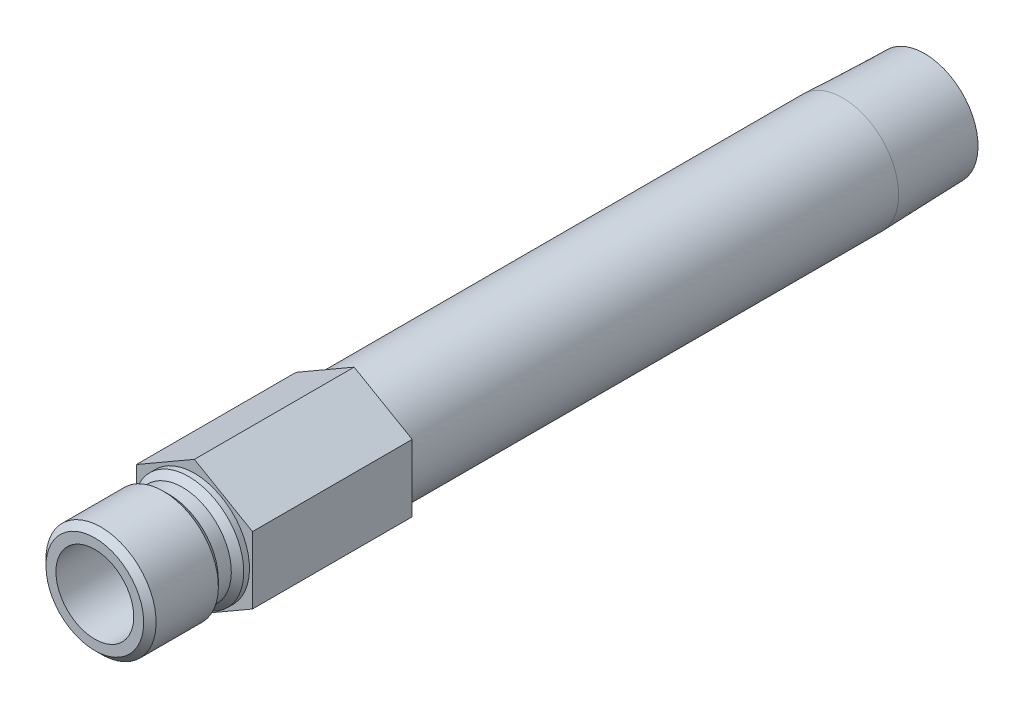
ISO-10303-21;
HEADER;
FILE_DESCRIPTION(('STEP AP214'),'2;1');
FILE_NAME('part.step','',(''),(''),'','','');
FILE_SCHEMA(('AUTOMOTIVE_DESIGN { 1 0 10303 214 1 1 1 1 }'));
ENDSEC;
DATA;
#1=APPLICATION_CONTEXT('core data for automotive mechanical design processes');
#2=APPLICATION_PROTOCOL_DEFINITION('international standard','automotive_design',2000,#1);
#3=PRODUCT_CONTEXT('',#1,'mechanical');
#4=PRODUCT('Part','Part','',(#3));
#5=PRODUCT_RELATED_PRODUCT_CATEGORY('part','',(#4));
#6=PRODUCT_DEFINITION_FORMATION('','',#4);
#7=PRODUCT_DEFINITION_CONTEXT('part definition',#1,'design');
#8=PRODUCT_DEFINITION('design','',#6,#7);
#9=PRODUCT_DEFINITION_SHAPE('','',#8);
#10=(LENGTH_UNIT() NAMED_UNIT(*) SI_UNIT(.MILLI.,.METRE.));
#11=(NAMED_UNIT(*) PLANE_ANGLE_UNIT() SI_UNIT($,.RADIAN.));
#12=(NAMED_UNIT(*) SI_UNIT($,.STERADIAN.) SOLID_ANGLE_UNIT());
#13=UNCERTAINTY_MEASURE_WITH_UNIT(LENGTH_MEASURE(1.E-05),#10,'distance_accuracy_value','');
#14=(GEOMETRIC_REPRESENTATION_CONTEXT(3) GLOBAL_UNCERTAINTY_ASSIGNED_CONTEXT((#13)) GLOBAL_UNIT_ASSIGNED_CONTEXT((#10,
#11,#12)) REPRESENTATION_CONTEXT('',''));
#15=CARTESIAN_POINT('',(0.,0.,0.));
#16=DIRECTION('',(0.,0.,1.));
#17=DIRECTION('',(1.,0.,0.));
#18=AXIS2_PLACEMENT_3D('',#15,#16,#17);
#19=CARTESIAN_POINT('',(0.,0.,0.));
#20=DIRECTION('',(0.,0.,-1.));
#21=DIRECTION('',(0.,1.,0.));
#22=AXIS2_PLACEMENT_3D('',#19,#20,#21);
#23=CYLINDRICAL_SURFACE('',#22,4.7625);
#24=CARTESIAN_POINT('',(0.,0.,0.));
#25=DIRECTION('',(0.,0.,1.));
#26=DIRECTION('',(1.,0.,0.));
#27=AXIS2_PLACEMENT_3D('',#24,#25,#26);
#28=CIRCLE('',#27,4.7625);
#29=CARTESIAN_POINT('',(4.7625,0.,0.));
#30=VERTEX_POINT('',#29);
#31=EDGE_CURVE('E138',#30,#30,#28,.T.);
#32=ORIENTED_EDGE('',*,*,#31,.F.);
#33=EDGE_LOOP('',(#32));
#34=FACE_BOUND('',#33,.T.);
#35=CARTESIAN_POINT('',(0.,0.,12.192));
#36=DIRECTION('',(0.,0.,-1.));
#37=DIRECTION('',(0.,1.,0.));
#38=AXIS2_PLACEMENT_3D('',#35,#36,#37);
#39=CIRCLE('',#38,4.7625);
#40=CARTESIAN_POINT('',(0.,4.7625,12.192));
#41=VERTEX_POINT('',#40);
#42=EDGE_CURVE('E11',#41,#41,#39,.T.);
#43=ORIENTED_EDGE('',*,*,#42,.F.);
#44=EDGE_LOOP('',(#43));
#45=FACE_BOUND('',#44,.T.);
#46=ADVANCED_FACE('F33',(#34,#45),#23,.F.);
#47=CARTESIAN_POINT('',(0.,4.7625,12.192));
#48=DIRECTION('',(0.,0.,1.));
#49=DIRECTION('',(0.,-1.,0.));
#50=AXIS2_PLACEMENT_3D('',#47,#48,#49);
#51=PLANE('',#50);
#52=ORIENTED_EDGE('',*,*,#42,.T.);
#53=EDGE_LOOP('',(#52));
#54=FACE_BOUND('',#53,.T.);
#55=CARTESIAN_POINT('',(0.,0.,12.192));
#56=DIRECTION('',(0.,0.,-1.));
#57=DIRECTION('',(0.,1.,0.));
#58=AXIS2_PLACEMENT_3D('',#55,#56,#57);
#59=CIRCLE('',#58,5.9817);
#60=CARTESIAN_POINT('',(0.,5.9817,12.192));
#61=VERTEX_POINT('',#60);
#62=EDGE_CURVE('E41',#61,#61,#59,.T.);
#63=ORIENTED_EDGE('',*,*,#62,.F.);
#64=EDGE_LOOP('',(#63));
#65=FACE_BOUND('',#64,.T.);
#66=ADVANCED_FACE('F181',(#54,#65),#51,.T.);
#67=CARTESIAN_POINT('',(0.,0.,11.43));
#68=DIRECTION('',(0.,0.,-1.));
#69=DIRECTION('',(0.,1.,0.));
#70=AXIS2_PLACEMENT_3D('',#67,#68,#69);
#71=CONICAL_SURFACE('',#70,6.7437,0.785398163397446);
#72=ORIENTED_EDGE('',*,*,#62,.T.);
#73=EDGE_LOOP('',(#72));
#74=FACE_BOUND('',#73,.T.);
#75=CARTESIAN_POINT('',(0.,0.,11.43));
#76=DIRECTION('',(0.,0.,-1.));
#77=DIRECTION('',(0.,1.,0.));
#78=AXIS2_PLACEMENT_3D('',#75,#76,#77);
#79=CIRCLE('',#78,6.7437);
#80=CARTESIAN_POINT('',(0.,6.7437,11.43));
#81=VERTEX_POINT('',#80);
#82=EDGE_CURVE('E173',#81,#81,#79,.T.);
#83=ORIENTED_EDGE('',*,*,#82,.F.);
#84=EDGE_LOOP('',(#83));
#85=FACE_BOUND('',#84,.T.);
#86=ADVANCED_FACE('F178',(#74,#85),#71,.T.);
#87=CARTESIAN_POINT('',(0.,0.,0.));
#88=DIRECTION('',(0.,0.,-1.));
#89=DIRECTION('',(0.,1.,0.));
#90=AXIS2_PLACEMENT_3D('',#87,#88,#89);
#91=CYLINDRICAL_SURFACE('',#90,6.7437);
#92=ORIENTED_EDGE('',*,*,#82,.T.);
#93=EDGE_LOOP('',(#92));
#94=FACE_BOUND('',#93,.T.);
#95=CARTESIAN_POINT('',(0.,0.,3.81));
#96=DIRECTION('',(0.,0.,-1.));
#97=DIRECTION('',(0.,1.,0.));
#98=AXIS2_PLACEMENT_3D('',#95,#96,#97);
#99=CIRCLE('',#98,6.7437);
#100=CARTESIAN_POINT('',(0.,6.7437,3.81));
#101=VERTEX_POINT('',#100);
#102=EDGE_CURVE('E170',#101,#101,#99,.T.);
#103=ORIENTED_EDGE('',*,*,#102,.F.);
#104=EDGE_LOOP('',(#103));
#105=FACE_BOUND('',#104,.T.);
#106=ADVANCED_FACE('F188',(#94,#105),#91,.T.);
#107=CARTESIAN_POINT('',(0.,0.,3.048));
#108=DIRECTION('',(0.,0.,1.));
#109=DIRECTION('',(0.,-1.,0.));
#110=AXIS2_PLACEMENT_3D('',#107,#108,#109);
#111=CONICAL_SURFACE('',#110,5.9817,0.785398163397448);
#112=ORIENTED_EDGE('',*,*,#102,.T.);
#113=EDGE_LOOP('',(#112));
#114=FACE_BOUND('',#113,.T.);
#115=CARTESIAN_POINT('',(0.,0.,3.048));
#116=DIRECTION('',(0.,0.,-1.));
#117=DIRECTION('',(0.,1.,0.));
#118=AXIS2_PLACEMENT_3D('',#115,#116,#117);
#119=CIRCLE('',#118,5.9817);
#120=CARTESIAN_POINT('',(0.,5.9817,3.048));
#121=VERTEX_POINT('',#120);
#122=EDGE_CURVE('E167',#121,#121,#119,.T.);
#123=ORIENTED_EDGE('',*,*,#122,.F.);
#124=EDGE_LOOP('',(#123));
#125=FACE_BOUND('',#124,.T.);
#126=ADVANCED_FACE('F194',(#114,#125),#111,.T.);
#127=CARTESIAN_POINT('',(0.,0.,0.));
#128=DIRECTION('',(0.,0.,-1.));
#129=DIRECTION('',(0.,1.,0.));
#130=AXIS2_PLACEMENT_3D('',#127,#128,#129);
#131=CYLINDRICAL_SURFACE('',#130,5.9817);
#132=ORIENTED_EDGE('',*,*,#122,.T.);
#133=EDGE_LOOP('',(#132));
#134=FACE_BOUND('',#133,.T.);
#135=CARTESIAN_POINT('',(0.,0.,1.4605));
#136=DIRECTION('',(0.,0.,-1.));
#137=DIRECTION('',(0.,1.,0.));
#138=AXIS2_PLACEMENT_3D('',#135,#136,#137);
#139=CIRCLE('',#138,5.9817);
#140=CARTESIAN_POINT('',(0.,5.9817,1.4605));
#141=VERTEX_POINT('',#140);
#142=EDGE_CURVE('E164',#141,#141,#139,.T.);
#143=ORIENTED_EDGE('',*,*,#142,.F.);
#144=EDGE_LOOP('',(#143));
#145=FACE_BOUND('',#144,.T.);
#146=ADVANCED_FACE('F198',(#134,#145),#131,.T.);
#147=CARTESIAN_POINT('',(0.,0.,0.698499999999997));
#148=DIRECTION('',(0.,0.,-1.));
#149=DIRECTION('',(0.,1.,0.));
#150=AXIS2_PLACEMENT_3D('',#147,#148,#149);
#151=CONICAL_SURFACE('',#150,6.7437,0.785398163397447);
#152=ORIENTED_EDGE('',*,*,#142,.T.);
#153=EDGE_LOOP('',(#152));
#154=FACE_BOUND('',#153,.T.);
#155=CARTESIAN_POINT('',(0.,0.,0.698499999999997));
#156=DIRECTION('',(0.,0.,-1.));
#157=DIRECTION('',(0.,1.,0.));
#158=AXIS2_PLACEMENT_3D('',#155,#156,#157);
#159=CIRCLE('',#158,6.7437);
#160=CARTESIAN_POINT('',(0.,6.7437,0.698499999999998));
#161=VERTEX_POINT('',#160);
#162=EDGE_CURVE('E161',#161,#161,#159,.T.);
#163=ORIENTED_EDGE('',*,*,#162,.F.);
#164=EDGE_LOOP('',(#163));
#165=FACE_BOUND('',#164,.T.);
#166=ADVANCED_FACE('F202',(#154,#165),#151,.T.);
#167=CARTESIAN_POINT('',(0.,0.,0.));
#168=DIRECTION('',(0.,0.,-1.));
#169=DIRECTION('',(0.,1.,0.));
#170=AXIS2_PLACEMENT_3D('',#167,#168,#169);
#171=CYLINDRICAL_SURFACE('',#170,6.7437);
#172=ORIENTED_EDGE('',*,*,#162,.T.);
#173=EDGE_LOOP('',(#172));
#174=FACE_BOUND('',#173,.T.);
#175=CARTESIAN_POINT('',(0.,0.,0.));
#176=DIRECTION('',(0.,0.,-1.));
#177=DIRECTION('',(0.,1.,0.));
#178=AXIS2_PLACEMENT_3D('',#175,#176,#177);
#179=CIRCLE('',#178,6.7437);
#180=CARTESIAN_POINT('',(0.,6.7437,0.));
#181=VERTEX_POINT('',#180);
#182=EDGE_CURVE('E158',#181,#181,#179,.T.);
#183=ORIENTED_EDGE('',*,*,#182,.F.);
#184=EDGE_LOOP('',(#183));
#185=FACE_BOUND('',#184,.T.);
#186=ADVANCED_FACE('F206',(#174,#185),#171,.T.);
#187=CARTESIAN_POINT('',(0.,6.7437,0.));
#188=DIRECTION('',(0.,0.,1.));
#189=DIRECTION('',(0.,-1.,0.));
#190=AXIS2_PLACEMENT_3D('',#187,#188,#189);
#191=PLANE('',#190);
#192=ORIENTED_EDGE('',*,*,#182,.T.);
#193=EDGE_LOOP('',(#192));
#194=FACE_BOUND('',#193,.T.);
#195=DIRECTION('',(-0.866025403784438,-0.5,0.));
#196=VECTOR('',#195,1.);
#197=CARTESIAN_POINT('',(0.,8.21223022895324,0.));
#198=LINE('',#197,#196);
#199=CARTESIAN_POINT('',(0.,8.21223022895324,0.));
#200=VERTEX_POINT('',#199);
#201=CARTESIAN_POINT('',(-7.112,4.10611511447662,0.));
#202=VERTEX_POINT('',#201);
#203=EDGE_CURVE('E120',#200,#202,#198,.T.);
#204=ORIENTED_EDGE('',*,*,#203,.T.);
#205=DIRECTION('',(0.,-1.,0.));
#206=VECTOR('',#205,1.);
#207=CARTESIAN_POINT('',(-7.112,4.10611511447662,0.));
#208=LINE('',#207,#206);
#209=CARTESIAN_POINT('',(-7.112,-4.10611511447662,0.));
#210=VERTEX_POINT('',#209);
#211=EDGE_CURVE('E123',#202,#210,#208,.T.);
#212=ORIENTED_EDGE('',*,*,#211,.T.);
#213=DIRECTION('',(0.866025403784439,-0.5,0.));
#214=VECTOR('',#213,1.);
#215=CARTESIAN_POINT('',(-7.112,-4.10611511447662,0.));
#216=LINE('',#215,#214);
#217=CARTESIAN_POINT('',(0.,-8.21223022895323,0.));
#218=VERTEX_POINT('',#217);
#219=EDGE_CURVE('E127',#210,#218,#216,.T.);
#220=ORIENTED_EDGE('',*,*,#219,.T.);
#221=DIRECTION('',(0.866025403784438,0.5,0.));
#222=VECTOR('',#221,1.);
#223=CARTESIAN_POINT('',(0.,-8.21223022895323,0.));
#224=LINE('',#223,#222);
#225=CARTESIAN_POINT('',(7.112,-4.10611511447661,0.));
#226=VERTEX_POINT('',#225);
#227=EDGE_CURVE('E130',#218,#226,#224,.T.);
#228=ORIENTED_EDGE('',*,*,#227,.T.);
#229=DIRECTION('',(0.,1.,0.));
#230=VECTOR('',#229,1.);
#231=CARTESIAN_POINT('',(7.112,-4.10611511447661,0.));
#232=LINE('',#231,#230);
#233=CARTESIAN_POINT('',(7.112,4.10611511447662,0.));
#234=VERTEX_POINT('',#233);
#235=EDGE_CURVE('E97',#226,#234,#232,.T.);
#236=ORIENTED_EDGE('',*,*,#235,.T.);
#237=DIRECTION('',(-0.866025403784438,0.5,0.));
#238=VECTOR('',#237,1.);
#239=CARTESIAN_POINT('',(7.112,4.10611511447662,0.));
#240=LINE('',#239,#238);
#241=EDGE_CURVE('E133',#234,#200,#240,.T.);
#242=ORIENTED_EDGE('',*,*,#241,.T.);
#243=EDGE_LOOP('',(#204,#212,#220,#228,#236,#242));
#244=FACE_BOUND('',#243,.T.);
#245=ADVANCED_FACE('F210',(#194,#244),#191,.T.);
#246=CARTESIAN_POINT('',(-7.112,4.10611511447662,0.));
#247=DIRECTION('',(0.,0.,1.));
#248=DIRECTION('',(1.,0.,0.));
#249=AXIS2_PLACEMENT_3D('',#246,#247,#248);
#250=PLANE('',#249);
#251=ORIENTED_EDGE('',*,*,#31,.T.);
#252=EDGE_LOOP('',(#251));
#253=FACE_BOUND('',#252,.T.);
#254=CARTESIAN_POINT('',(0.,0.,0.));
#255=DIRECTION('',(0.,0.,1.));
#256=DIRECTION('',(1.,0.,0.));
#257=AXIS2_PLACEMENT_3D('',#254,#255,#256);
#258=CIRCLE('',#257,4.62279999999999);
#259=CARTESIAN_POINT('',(4.62279999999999,0.,0.));
#260=VERTEX_POINT('',#259);
#261=EDGE_CURVE('E124',#260,#260,#258,.T.);
#262=ORIENTED_EDGE('',*,*,#261,.F.);
#263=EDGE_LOOP('',(#262));
#264=FACE_BOUND('',#263,.T.);
#265=ADVANCED_FACE('F214',(#253,#264),#250,.T.);
#266=CARTESIAN_POINT('',(0.,0.,-89.408));
#267=DIRECTION('',(0.,0.,1.));
#268=DIRECTION('',(0.,-1.,0.));
#269=AXIS2_PLACEMENT_3D('',#266,#267,#268);
#270=CONICAL_SURFACE('',#269,6.54447060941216,0.0312396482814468);
#271=CARTESIAN_POINT('',(0.,0.,-79.375));
#272=DIRECTION('',(0.,0.,-1.));
#273=DIRECTION('',(0.,1.,0.));
#274=AXIS2_PLACEMENT_3D('',#271,#272,#273);
#275=CIRCLE('',#274,6.85799999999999);
#276=CARTESIAN_POINT('',(0.,6.858,-79.375));
#277=VERTEX_POINT('',#276);
#278=EDGE_CURVE('E155',#277,#277,#275,.T.);
#279=ORIENTED_EDGE('',*,*,#278,.T.);
#280=EDGE_LOOP('',(#279));
#281=FACE_BOUND('',#280,.T.);
#282=CARTESIAN_POINT('',(0.,0.,-89.408));
#283=DIRECTION('',(0.,0.,-1.));
#284=DIRECTION('',(0.,1.,0.));
#285=AXIS2_PLACEMENT_3D('',#282,#283,#284);
#286=CIRCLE('',#285,6.54447060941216);
#287=CARTESIAN_POINT('',(0.,6.54447060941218,-89.408));
#288=VERTEX_POINT('',#287);
#289=EDGE_CURVE('E152',#288,#288,#286,.T.);
#290=ORIENTED_EDGE('',*,*,#289,.F.);
#291=EDGE_LOOP('',(#290));
#292=FACE_BOUND('',#291,.T.);
#293=ADVANCED_FACE('F220',(#281,#292),#270,.T.);
#294=CARTESIAN_POINT('',(0.,0.,0.));
#295=DIRECTION('',(0.,0.,-1.));
#296=DIRECTION('',(0.,1.,0.));
#297=AXIS2_PLACEMENT_3D('',#294,#295,#296);
#298=CYLINDRICAL_SURFACE('',#297,6.85799999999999);
#299=ORIENTED_EDGE('',*,*,#278,.F.);
#300=EDGE_LOOP('',(#299));
#301=FACE_BOUND('',#300,.T.);
#302=CARTESIAN_POINT('',(0.,0.,-19.558));
#303=DIRECTION('',(0.,0.,1.));
#304=DIRECTION('',(1.,0.,0.));
#305=AXIS2_PLACEMENT_3D('',#302,#303,#304);
#306=CIRCLE('',#305,6.85799999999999);
#307=CARTESIAN_POINT('',(6.85799999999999,0.,-19.558));
#308=VERTEX_POINT('',#307);
#309=EDGE_CURVE('E146',#308,#308,#306,.F.);
#310=ORIENTED_EDGE('',*,*,#309,.T.);
#311=EDGE_LOOP('',(#310));
#312=FACE_BOUND('',#311,.T.);
#313=ADVANCED_FACE('F216',(#301,#312),#298,.T.);
#314=CARTESIAN_POINT('',(0.,6.54447060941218,-89.408));
#315=DIRECTION('',(0.,0.,-1.));
#316=DIRECTION('',(0.,1.,0.));
#317=AXIS2_PLACEMENT_3D('',#314,#315,#316);
#318=PLANE('',#317);
#319=ORIENTED_EDGE('',*,*,#289,.T.);
#320=EDGE_LOOP('',(#319));
#321=FACE_BOUND('',#320,.T.);
#322=CARTESIAN_POINT('',(0.,0.,-89.408));
#323=DIRECTION('',(0.,0.,-1.));
#324=DIRECTION('',(0.,1.,0.));
#325=AXIS2_PLACEMENT_3D('',#322,#323,#324);
#326=CIRCLE('',#325,4.62279999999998);
#327=CARTESIAN_POINT('',(0.,4.6228,-89.408));
#328=VERTEX_POINT('',#327);
#329=EDGE_CURVE('E149',#328,#328,#326,.T.);
#330=ORIENTED_EDGE('',*,*,#329,.F.);
#331=EDGE_LOOP('',(#330));
#332=FACE_BOUND('',#331,.T.);
#333=ADVANCED_FACE('F219',(#321,#332),#318,.T.);
#334=CARTESIAN_POINT('',(0.,0.,0.));
#335=DIRECTION('',(0.,0.,-1.));
#336=DIRECTION('',(0.,1.,0.));
#337=AXIS2_PLACEMENT_3D('',#334,#335,#336);
#338=CYLINDRICAL_SURFACE('',#337,4.62279999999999);
#339=ORIENTED_EDGE('',*,*,#261,.T.);
#340=EDGE_LOOP('',(#339));
#341=FACE_BOUND('',#340,.T.);
#342=ORIENTED_EDGE('',*,*,#329,.T.);
#343=EDGE_LOOP('',(#342));
#344=FACE_BOUND('',#343,.T.);
#345=ADVANCED_FACE('F227',(#341,#344),#338,.F.);
#346=CARTESIAN_POINT('',(0.,8.21223022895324,-19.558));
#347=DIRECTION('',(-0.5,0.866025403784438,0.));
#348=DIRECTION('',(-0.866025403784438,-0.5,0.));
#349=AXIS2_PLACEMENT_3D('',#346,#347,#348);
#350=PLANE('',#349);
#351=ORIENTED_EDGE('',*,*,#203,.F.);
#352=DIRECTION('',(0.,0.,1.));
#353=VECTOR('',#352,1.);
#354=CARTESIAN_POINT('',(0.,8.21223022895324,-19.558));
#355=LINE('',#354,#353);
#356=CARTESIAN_POINT('',(0.,8.21223022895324,-19.558));
#357=VERTEX_POINT('',#356);
#358=EDGE_CURVE('E49',#357,#200,#355,.T.);
#359=ORIENTED_EDGE('',*,*,#358,.F.);
#360=DIRECTION('',(-0.866025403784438,-0.5,0.));
#361=VECTOR('',#360,1.);
#362=CARTESIAN_POINT('',(0.,8.21223022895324,-19.558));
#363=LINE('',#362,#361);
#364=CARTESIAN_POINT('',(-7.112,4.10611511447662,-19.558));
#365=VERTEX_POINT('',#364);
#366=EDGE_CURVE('E136',#357,#365,#363,.T.);
#367=ORIENTED_EDGE('',*,*,#366,.T.);
#368=DIRECTION('',(0.,0.,1.));
#369=VECTOR('',#368,1.);
#370=CARTESIAN_POINT('',(-7.112,4.10611511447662,-19.558));
#371=LINE('',#370,#369);
#372=EDGE_CURVE('E84',#365,#202,#371,.T.);
#373=ORIENTED_EDGE('',*,*,#372,.T.);
#374=EDGE_LOOP('',(#351,#359,#367,#373));
#375=FACE_BOUND('',#374,.T.);
#376=ADVANCED_FACE('F231',(#375),#350,.T.);
#377=CARTESIAN_POINT('',(7.112,4.10611511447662,-19.558));
#378=DIRECTION('',(0.5,0.866025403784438,0.));
#379=DIRECTION('',(-0.866025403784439,0.5,0.));
#380=AXIS2_PLACEMENT_3D('',#377,#378,#379);
#381=PLANE('',#380);
#382=ORIENTED_EDGE('',*,*,#241,.F.);
#383=DIRECTION('',(0.,0.,1.));
#384=VECTOR('',#383,1.);
#385=CARTESIAN_POINT('',(7.112,4.10611511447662,-19.558));
#386=LINE('',#385,#384);
#387=CARTESIAN_POINT('',(7.112,4.10611511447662,-19.558));
#388=VERTEX_POINT('',#387);
#389=EDGE_CURVE('E72',#388,#234,#386,.T.);
#390=ORIENTED_EDGE('',*,*,#389,.F.);
#391=DIRECTION('',(-0.866025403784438,0.5,0.));
#392=VECTOR('',#391,1.);
#393=CARTESIAN_POINT('',(7.112,4.10611511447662,-19.558));
#394=LINE('',#393,#392);
#395=EDGE_CURVE('E110',#388,#357,#394,.T.);
#396=ORIENTED_EDGE('',*,*,#395,.T.);
#397=ORIENTED_EDGE('',*,*,#358,.T.);
#398=EDGE_LOOP('',(#382,#390,#396,#397));
#399=FACE_BOUND('',#398,.T.);
#400=ADVANCED_FACE('F235',(#399),#381,.T.);
#401=CARTESIAN_POINT('',(7.112,-4.10611511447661,-19.558));
#402=DIRECTION('',(1.,0.,0.));
#403=DIRECTION('',(0.,1.,0.));
#404=AXIS2_PLACEMENT_3D('',#401,#402,#403);
#405=PLANE('',#404);
#406=ORIENTED_EDGE('',*,*,#235,.F.);
#407=DIRECTION('',(0.,0.,1.));
#408=VECTOR('',#407,1.);
#409=CARTESIAN_POINT('',(7.112,-4.10611511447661,-19.558));
#410=LINE('',#409,#408);
#411=CARTESIAN_POINT('',(7.112,-4.10611511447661,-19.558));
#412=VERTEX_POINT('',#411);
#413=EDGE_CURVE('E92',#412,#226,#410,.T.);
#414=ORIENTED_EDGE('',*,*,#413,.F.);
#415=DIRECTION('',(0.,1.,0.));
#416=VECTOR('',#415,1.);
#417=CARTESIAN_POINT('',(7.112,-4.10611511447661,-19.558));
#418=LINE('',#417,#416);
#419=EDGE_CURVE('E95',#412,#388,#418,.T.);
#420=ORIENTED_EDGE('',*,*,#419,.T.);
#421=ORIENTED_EDGE('',*,*,#389,.T.);
#422=EDGE_LOOP('',(#406,#414,#420,#421));
#423=FACE_BOUND('',#422,.T.);
#424=ADVANCED_FACE('F94',(#423),#405,.T.);
#425=CARTESIAN_POINT('',(0.,-8.21223022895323,-19.558));
#426=DIRECTION('',(0.5,-0.866025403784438,0.));
#427=DIRECTION('',(0.866025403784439,0.5,0.));
#428=AXIS2_PLACEMENT_3D('',#425,#426,#427);
#429=PLANE('',#428);
#430=ORIENTED_EDGE('',*,*,#227,.F.);
#431=DIRECTION('',(0.,0.,1.));
#432=VECTOR('',#431,1.);
#433=CARTESIAN_POINT('',(0.,-8.21223022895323,-19.558));
#434=LINE('',#433,#432);
#435=CARTESIAN_POINT('',(0.,-8.21223022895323,-19.558));
#436=VERTEX_POINT('',#435);
#437=EDGE_CURVE('E102',#436,#218,#434,.T.);
#438=ORIENTED_EDGE('',*,*,#437,.F.);
#439=DIRECTION('',(0.866025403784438,0.5,0.));
#440=VECTOR('',#439,1.);
#441=CARTESIAN_POINT('',(0.,-8.21223022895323,-19.558));
#442=LINE('',#441,#440);
#443=EDGE_CURVE('E108',#436,#412,#442,.T.);
#444=ORIENTED_EDGE('',*,*,#443,.T.);
#445=ORIENTED_EDGE('',*,*,#413,.T.);
#446=EDGE_LOOP('',(#430,#438,#444,#445));
#447=FACE_BOUND('',#446,.T.);
#448=ADVANCED_FACE('F112',(#447),#429,.T.);
#449=CARTESIAN_POINT('',(-7.112,-4.10611511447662,-19.558));
#450=DIRECTION('',(-0.5,-0.866025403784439,0.));
#451=DIRECTION('',(0.866025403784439,-0.5,0.));
#452=AXIS2_PLACEMENT_3D('',#449,#450,#451);
#453=PLANE('',#452);
#454=ORIENTED_EDGE('',*,*,#219,.F.);
#455=DIRECTION('',(0.,0.,1.));
#456=VECTOR('',#455,1.);
#457=CARTESIAN_POINT('',(-7.112,-4.10611511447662,-19.558));
#458=LINE('',#457,#456);
#459=CARTESIAN_POINT('',(-7.112,-4.10611511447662,-19.558));
#460=VERTEX_POINT('',#459);
#461=EDGE_CURVE('E141',#460,#210,#458,.T.);
#462=ORIENTED_EDGE('',*,*,#461,.F.);
#463=DIRECTION('',(0.866025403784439,-0.5,0.));
#464=VECTOR('',#463,1.);
#465=CARTESIAN_POINT('',(-7.112,-4.10611511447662,-19.558));
#466=LINE('',#465,#464);
#467=EDGE_CURVE('E113',#460,#436,#466,.T.);
#468=ORIENTED_EDGE('',*,*,#467,.T.);
#469=ORIENTED_EDGE('',*,*,#437,.T.);
#470=EDGE_LOOP('',(#454,#462,#468,#469));
#471=FACE_BOUND('',#470,.T.);
#472=ADVANCED_FACE('F239',(#471),#453,.T.);
#473=CARTESIAN_POINT('',(-7.112,4.10611511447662,-19.558));
#474=DIRECTION('',(-1.,0.,0.));
#475=DIRECTION('',(0.,-1.,0.));
#476=AXIS2_PLACEMENT_3D('',#473,#474,#475);
#477=PLANE('',#476);
#478=ORIENTED_EDGE('',*,*,#211,.F.);
#479=ORIENTED_EDGE('',*,*,#372,.F.);
#480=DIRECTION('',(0.,-1.,0.));
#481=VECTOR('',#480,1.);
#482=CARTESIAN_POINT('',(-7.112,4.10611511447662,-19.558));
#483=LINE('',#482,#481);
#484=EDGE_CURVE('E115',#365,#460,#483,.T.);
#485=ORIENTED_EDGE('',*,*,#484,.T.);
#486=ORIENTED_EDGE('',*,*,#461,.T.);
#487=EDGE_LOOP('',(#478,#479,#485,#486));
#488=FACE_BOUND('',#487,.T.);
#489=ADVANCED_FACE('F236',(#488),#477,.T.);
#490=CARTESIAN_POINT('',(-7.112,4.10611511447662,-19.558));
#491=DIRECTION('',(0.,0.,1.));
#492=DIRECTION('',(1.,0.,0.));
#493=AXIS2_PLACEMENT_3D('',#490,#491,#492);
#494=PLANE('',#493);
#495=ORIENTED_EDGE('',*,*,#309,.F.);
#496=EDGE_LOOP('',(#495));
#497=FACE_BOUND('',#496,.T.);
#498=ORIENTED_EDGE('',*,*,#366,.F.);
#499=ORIENTED_EDGE('',*,*,#395,.F.);
#500=ORIENTED_EDGE('',*,*,#419,.F.);
#501=ORIENTED_EDGE('',*,*,#443,.F.);
#502=ORIENTED_EDGE('',*,*,#467,.F.);
#503=ORIENTED_EDGE('',*,*,#484,.F.);
#504=EDGE_LOOP('',(#498,#499,#500,#501,#502,#503));
#505=FACE_BOUND('',#504,.T.);
#506=ADVANCED_FACE('F106',(#497,#505),#494,.F.);
#507=CLOSED_SHELL('',(#46,#66,#86,#106,#126,#146,#166,#186,#245,#265,#293,#313,#333,#345,#376,
#400,#424,#448,#472,#489,#506));
#508=MANIFOLD_SOLID_BREP('B2',#507);
#509=ADVANCED_BREP_SHAPE_REPRESENTATION('',(#18,#508),#14);
#510=SHAPE_DEFINITION_REPRESENTATION(#9,#509);
ENDSEC;
END-ISO-10303-21;
